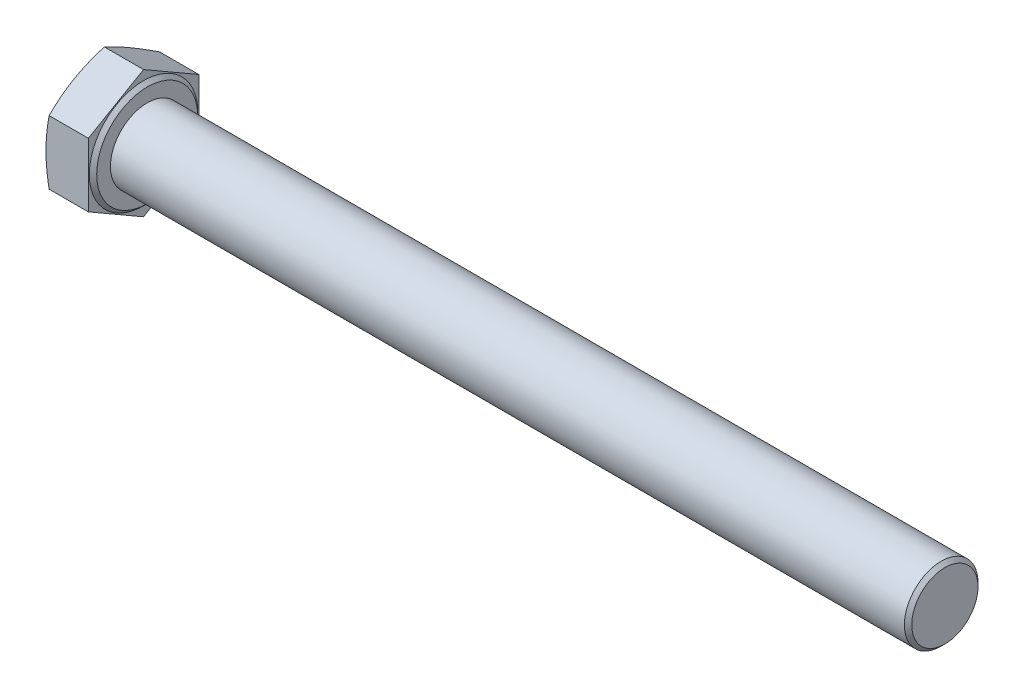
from build123d import *

# Parameters (mm, degrees)
BASEHEAD_DEPTH = 7.5
SKETCH5_R      = 6
BASEBODY_DEPTH = 130
CHAMFER1_SIZE  = 0.6


with BuildPart() as part:
    # Sketch2 → BaseHead (new body)
    with BuildSketch(Plane(origin=(0, 0, 0), x_dir=(0, 0, -1), z_dir=(1, 0, 0))):
        Polygon((0, -10.392304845), (9, -5.196152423), (9, 5.196152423), (0, 10.392304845), (-9, 5.196152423), (-9, -5.196152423), align=None)
    extrude(amount=BASEHEAD_DEPTH)

    # Sketch3 → BearingFace (revolve, cut)
    with BuildSketch(Plane.XY, mode=Mode.PRIVATE) as bearingface_sk:
        Polygon((7.5, 10.392304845), (7.5, 8.235), (6.9, 8.835), (6.9, 10.392304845), align=None)
    revolve(bearingface_sk.sketch.rotate(Axis((-0.957090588, 0, 0), (1, 0, 0)), 90), axis=Axis((-0.957090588, 0, 0), (1, 0, 0)), mode=Mode.SUBTRACT)

    # Sketch4 → HeadChamfer (revolve, cut)
    with BuildSketch(Plane.XY):
        Polygon((0, 10.392304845), (0.506757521, 10.392304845), (0, 9), align=None)
    revolve(axis=Axis((-0.493528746, 0, 0), (1, 0, 0)), mode=Mode.SUBTRACT)

    # Sketch5 → BaseBody (add)
    with BuildSketch(Plane(origin=(7.5, 0, 0), x_dir=(0, 0, -1), z_dir=(1, 0, 0))):
        with Locations(Location((0, 0, 0), (0, 0, 180))):
            Circle(SKETCH5_R)
    extrude(amount=BASEBODY_DEPTH)

    # Chamfer1
    chamfer1_edges = [part.edges().sort_by_distance(p)[0] for p in [
        (137.5, 0, -6),
    ]]
    chamfer(chamfer1_edges, length=CHAMFER1_SIZE)


solid = part.part
